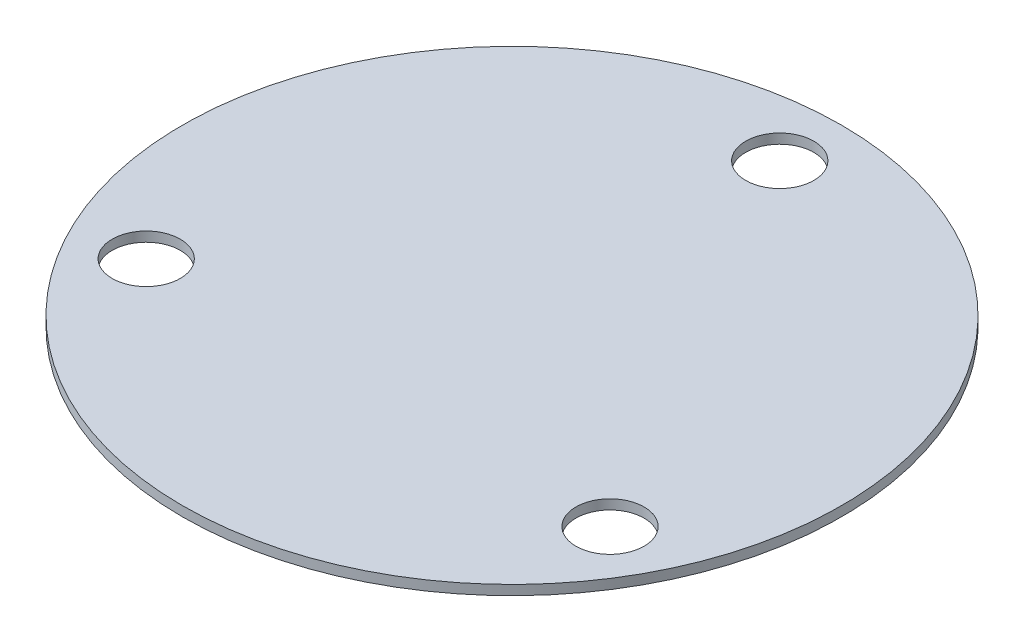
from build123d import *

# Parameters (mm, degrees)
SKETCH1_R           = 101.6
BOSS_EXTRUDE1_DEPTH = 3
SKETCH2_R           = 10.5
CUT_EXTRUDE1_DEPTH  = 10


with BuildPart() as part:
    # Sketch1 → Boss-Extrude1 (new body)
    with BuildSketch(Plane(origin=(0, 0, 0), x_dir=(1, 0, 0), z_dir=(0, 1, 0))):
        with Locations(Location((0, 0, 0), (0, 0, 270))):
            Circle(SKETCH1_R)
    extrude(amount=BOSS_EXTRUDE1_DEPTH)

    # Sketch2 → Cut-Extrude1 (cut)
    with BuildSketch(Plane(origin=(0, 3, 0), x_dir=(1, 0, 0), z_dir=(0, 1, 0))):
        with Locations(Location((0, 82.55, 0), (0, 0, 270))):
            Circle(SKETCH2_R)
        with Locations(Location((-71.490397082, -41.275, 0), (0, 0, 270))):
            Circle(SKETCH2_R)
        with Locations(Location((71.490397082, -41.275, 0), (0, 0, 270))):
            Circle(SKETCH2_R)
    extrude(amount=-CUT_EXTRUDE1_DEPTH, mode=Mode.SUBTRACT)


solid = part.part
